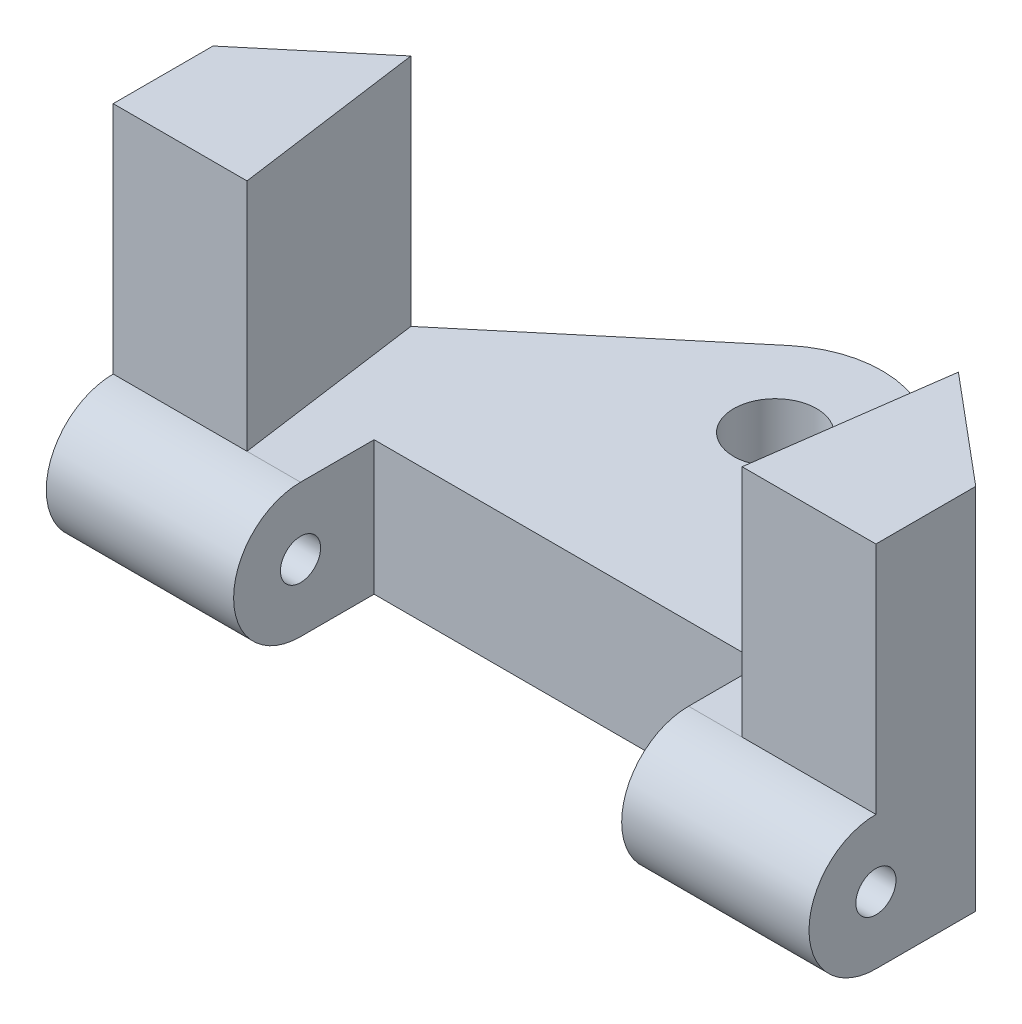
from build123d import *

# Parameters (mm, degrees)
SKETCH_1_W               = 57
SKETCH_1_H               = 55
SKETCH_1_W_2             = 37
SKETCH_1_H_2             = 35
EXTRUDE_1_DEPTH          = 9
SKETCH_4_R               = 5
SKETCH_4_R_2             = 1.5
EXTRUDE_2_DEPTH          = 14
SKETCH_2_4_W             = 10
SKETCH_2_4_H             = 5.5
EXTRUDE_3_DEPTH          = 35
CUT_EXTRUDE_4_DEPTH      = 30
SKETCH_2_10_R            = 3.1
EXTRUDE_7_DEPTH          = 10
CUT_EXTRUDE_7_DEPTH      = 41.266153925
CUT_EXTRUDE_7_DEPTH_BACK = 10
CUT_EXTRUDE_8_DEPTH      = 17.5


with BuildPart() as part:
    # Sketch 1 → Extrude 1 (new body)
    with BuildSketch(Plane.XY):
        with Locations((2.075531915, -11.959574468)):
            Rectangle(SKETCH_1_W, SKETCH_1_H)
        with Locations((2.075531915, -11.959574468)):
            Rectangle(SKETCH_1_W_2, SKETCH_1_H_2, mode=Mode.SUBTRACT)
    extrude(amount=EXTRUDE_1_DEPTH)

    # Sketch 4 → Extrude 2 (add)
    # profile 1 of 4: a face of its own
    with BuildSketch(Plane.ZY.offset(26.424468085)):
        with BuildLine():
            Line((9, 15.540425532), (9, 5.540425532))
            Line((9, 5.540425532), (14.500000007, 5.540425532))
            ThreePointArc((14.500000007, 5.540425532), (9.5, 10.540425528), (14.5, 15.540425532))
            Line((14.5, 15.540425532), (9, 15.540425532))
        make_face()
    # profile 2 of 4: a face of its own
    with BuildSketch(Plane.ZY.offset(26.424468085)):
        with Locations((14.5, 10.540425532)):
            Circle(SKETCH_4_R)
        with Locations(Location((14.5, 10.540425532, 0), (0, 0, 270))):
            Circle(SKETCH_4_R_2, mode=Mode.SUBTRACT)
    # profile 3 of 4: a face of its own
    with BuildSketch(Plane.ZY.offset(26.424468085)):
        with Locations((14.5, -34.459574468)):
            Circle(SKETCH_4_R)
        with Locations(Location((14.5, -34.459574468, 0), (0, 0, 270))):
            Circle(SKETCH_4_R_2, mode=Mode.SUBTRACT)
    # profile 4 of 4: a face of its own
    with BuildSketch(Plane.ZY.offset(26.424468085)):
        with BuildLine():
            Line((14.5, -29.459574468), (9, -29.459574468))
            Line((9, -29.459574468), (9, -39.459574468))
            Line((9, -39.459574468), (14.5, -39.459574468))
            ThreePointArc((14.5, -39.459574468), (9.5, -34.459574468), (14.5, -29.459574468))
        make_face()
    extrude_2 = extrude(amount=-EXTRUDE_2_DEPTH)

    # Mirror 1: Extrude 2 across plane
    add(extrude_2.mirror(Plane.ZY.offset(-2.075531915)))

    # Sketch 2_4 → Extrude 3 (add)
    with BuildSketch(Plane(origin=(0, -29.459574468, 0), x_dir=(1, 0, 0), z_dir=(0, 1, 0))):
        with Locations((-21.424468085, -11.75)):
            Rectangle(SKETCH_2_4_W, SKETCH_2_4_H)
        with Locations((25.575531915, -11.75)):
            Rectangle(SKETCH_2_4_W, SKETCH_2_4_H)
    extrude(amount=EXTRUDE_3_DEPTH)

    # Sketch 3 → Cut-Extrude 4 (cut)
    with BuildSketch(Plane(origin=(0, -11.959574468, 0), x_dir=(-1, 0, 0), z_dir=(0, -1, 0))):
        Polygon((26.424468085, 0), (-30.575531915, 0), (-30.575531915, -14.5), (-16.575531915, -14.5), (-16.575531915, -9), (12.424468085, -9), (12.424468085, -14.5), (26.424468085, -14.5), align=None)
    extrude(amount=-CUT_EXTRUDE_4_DEPTH, mode=Mode.SUBTRACT)


with BuildPart() as body_2:
    # of the pieces the cut leaves, the one that is kept (cut_extrude_4_keep)
    add(part.part.solids().sort_by_distance((-26.424468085, -39.459574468, 0))[0])

    # Sketch 2_10 → Extrude 7 (add)
    # profile 1 of 10: a face of its own
    with BuildSketch(Plane(origin=(0, -29.459574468, 0), x_dir=(1, 0, 0), z_dir=(0, 1, 0))):
        with BuildLine():
            Line((-16.424468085, 1.350206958), (-16.424468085, 0))
            Line((-16.424468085, 0), (-2.633580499, 0))
            ThreePointArc((-2.633580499, 0), (-5.673576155, 4.556125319), (-5.070185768, 10))
            Line((-5.070185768, 10), (-6.116046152, 10))
            Line((-6.116046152, 10), (-16.424468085, 1.350206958))
        make_face()
    # profile 2 of 10: a face of its own
    with BuildSketch(Plane(origin=(0, -29.459574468, 0), x_dir=(1, 0, 0), z_dir=(0, 1, 0))):
        with BuildLine():
            Line((-2.633580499, 0), (6.831618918, 0))
            ThreePointArc((6.831618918, 0), (9.235572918, 2.834809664), (10.099019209, 6.45))
            ThreePointArc((10.099019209, 6.45), (9.888551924, 8.272959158), (9.268224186, 10))
            Line((9.268224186, 10), (-5.070185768, 10))
            ThreePointArc((-5.070185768, 10), (-5.673576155, 4.556125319), (-2.633580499, 0))
        make_face()
        with Locations(Location((2.099019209, 6.45, 0), (0, 0, 270))):
            Circle(SKETCH_2_10_R, mode=Mode.SUBTRACT)
    # profile 3 of 10: a face of its own
    with BuildSketch(Plane(origin=(0, -29.459574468, 0), x_dir=(1, 0, 0), z_dir=(0, 1, 0))):
        with BuildLine():
            Line((9.268224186, 10), (10.267109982, 10))
            Line((10.267109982, 10), (7.75385912, 12.108867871))
            ThreePointArc((7.75385912, 12.108867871), (8.597162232, 11.116276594), (9.268224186, 10))
        make_face()
    # profile 4 of 10: a face of its own
    with BuildSketch(Plane(origin=(0, -29.459574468, 0), x_dir=(1, 0, 0), z_dir=(0, 1, 0))):
        with BuildLine():
            ThreePointArc((-3.043281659, 12.578355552), (-4.190279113, 11.394160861), (-5.070185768, 10))
            Line((-5.070185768, 10), (9.268224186, 10))
            ThreePointArc((9.268224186, 10), (8.597162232, 11.116276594), (7.75385912, 12.108867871))
            Line((7.75385912, 12.108867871), (6.689963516, 13.00158228))
            ThreePointArc((6.689963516, 13.00158228), (1.751486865, 14.442447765), (-3.043281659, 12.578355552))
        make_face()
    # profile 5 of 10: a face of its own
    with BuildSketch(Plane(origin=(0, -29.459574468, 0), x_dir=(1, 0, 0), z_dir=(0, 1, 0))):
        with BuildLine():
            Line((-6.116046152, 10), (-5.070185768, 10))
            ThreePointArc((-5.070185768, 10), (-4.190279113, 11.394160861), (-3.043281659, 12.578355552))
            Line((-3.043281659, 12.578355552), (-6.116046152, 10))
        make_face()
    # profile 6 of 10: a face of its own
    with BuildSketch(Plane(origin=(0, -29.459574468, 0), x_dir=(1, 0, 0), z_dir=(0, 1, 0))):
        with BuildLine():
            Line((9.268224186, 10), (10.267109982, 10))
            Line((10.267109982, 10), (7.75385912, 12.108867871))
            ThreePointArc((7.75385912, 12.108867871), (8.597162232, 11.116276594), (9.268224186, 10))
        make_face()
    # profile 7 of 10: a face of its own
    with BuildSketch(Plane(origin=(0, -29.459574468, 0), x_dir=(1, 0, 0), z_dir=(0, 1, 0))):
        with BuildLine():
            ThreePointArc((-3.043281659, 12.578355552), (-4.190279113, 11.394160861), (-5.070185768, 10))
            Line((-5.070185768, 10), (9.268224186, 10))
            ThreePointArc((9.268224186, 10), (8.597162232, 11.116276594), (7.75385912, 12.108867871))
            Line((7.75385912, 12.108867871), (6.689963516, 13.00158228))
            ThreePointArc((6.689963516, 13.00158228), (1.751486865, 14.442447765), (-3.043281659, 12.578355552))
        make_face()
    # profile 8 of 10: a face of its own
    with BuildSketch(Plane(origin=(0, -29.459574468, 0), x_dir=(1, 0, 0), z_dir=(0, 1, 0))):
        with BuildLine():
            Line((6.831618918, 0), (20.575531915, 0))
            Line((20.575531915, 0), (20.575531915, 1.350206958))
            Line((20.575531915, 1.350206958), (10.267109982, 10))
            Line((10.267109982, 10), (9.268224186, 10))
            ThreePointArc((9.268224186, 10), (9.888551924, 8.272959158), (10.099019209, 6.45))
            ThreePointArc((10.099019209, 6.45), (9.235572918, 2.834809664), (6.831618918, 0))
        make_face()
    # profile 9 of 10: a face of its own
    with BuildSketch(Plane(origin=(0, -29.459574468, 0), x_dir=(1, 0, 0), z_dir=(0, 1, 0))):
        Polygon((-18.033582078, 0), (-16.424468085, 0), (-16.424468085, 1.350206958), align=None)
    # profile 10 of 10: a face of its own
    with BuildSketch(Plane(origin=(0, -29.459574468, 0), x_dir=(1, 0, 0), z_dir=(0, 1, 0))):
        Polygon((20.575531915, 1.350206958), (20.575531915, 0), (22.184645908, 0), align=None)
    extrude(amount=-EXTRUDE_7_DEPTH)

    # Sketch 2_11 → Cut-Extrude 7 (cut, two sides: drawn at the far end of the back side and taken through both)
    with BuildSketch(Plane(origin=(0, -29.459574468, 0), x_dir=(1, 0, 0), z_dir=(0, 1, 0)).offset(-CUT_EXTRUDE_7_DEPTH_BACK)):
        Polygon((-26.424468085, 0), (-26.424468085, -7.040789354), (-18.033582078, 0), align=None)
        Polygon((30.575531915, 0), (22.184645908, 0), (30.575531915, -7.040789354), align=None)
    extrude(amount=CUT_EXTRUDE_7_DEPTH + CUT_EXTRUDE_7_DEPTH_BACK, mode=Mode.SUBTRACT)

    # Sketch 6 → Cut-Extrude 8 (cut)
    with BuildSketch(Plane(origin=(0, -11.959574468, 0), x_dir=(1, 0, 0), z_dir=(0, 1, 0))):
        Polygon((20.575531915, 0), (20.575531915, -14.5), (22.534984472, -0.29396896), (22.184645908, 0), align=None)
        Polygon((-16.424468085, -14.5), (-16.424468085, 0), (-18.033582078, 0), (-18.383920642, -0.29396896), align=None)
    extrude(amount=-CUT_EXTRUDE_8_DEPTH, mode=Mode.SUBTRACT)


solid = body_2.part
